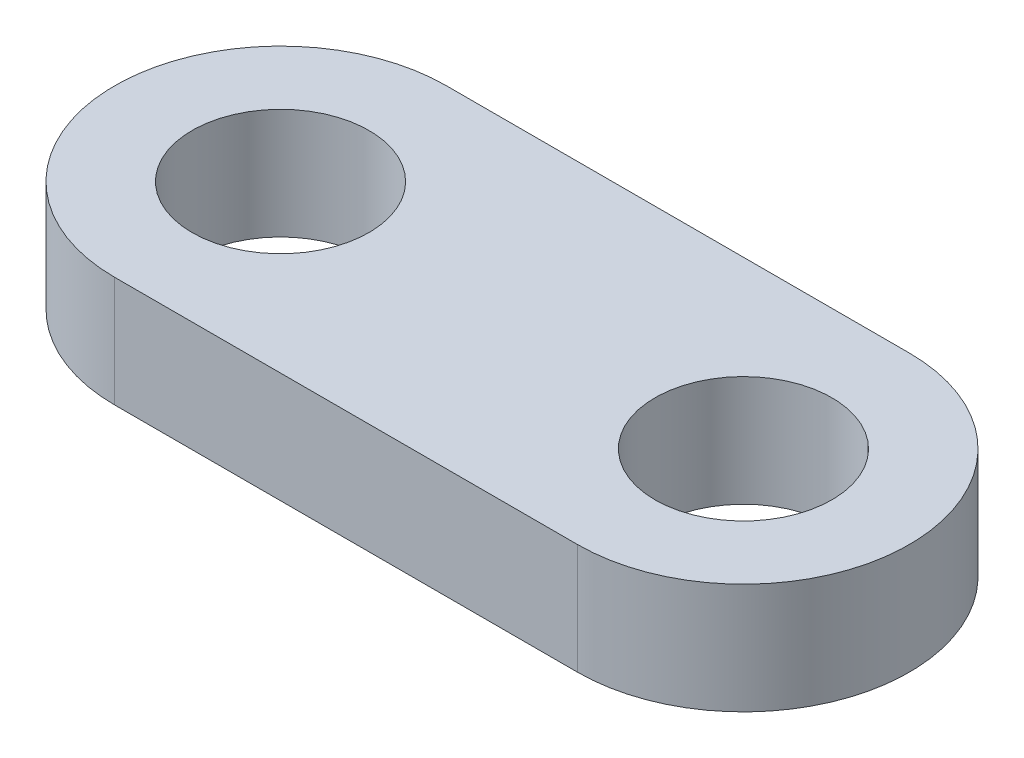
from build123d import *

# Parameters (mm, degrees)
SKETCH1_R           = 4
BOSS_EXTRUDE1_DEPTH = 5


with BuildPart() as part:
    # Sketch1 → Boss-Extrude1 (new body)
    with BuildSketch(Plane(origin=(0, 0, 0), x_dir=(1, 0, 0), z_dir=(0, 1, 0))):
        with BuildLine():
            Line((0, 7.5), (20.93, 7.5))
            ThreePointArc((20.93, 7.5), (28.43, 0), (20.93, -7.5))
            Line((20.93, -7.5), (0, -7.5))
            ThreePointArc((0, -7.5), (-7.5, 0), (0, 7.5))
        make_face()
        with Locations(Location((20.93, 0, 0), (0, 0, 270))):
            Circle(SKETCH1_R, mode=Mode.SUBTRACT)
        with Locations(Location((0, 0, 0), (0, 0, 270))):
            Circle(SKETCH1_R, mode=Mode.SUBTRACT)
    extrude(amount=BOSS_EXTRUDE1_DEPTH)


solid = part.part
